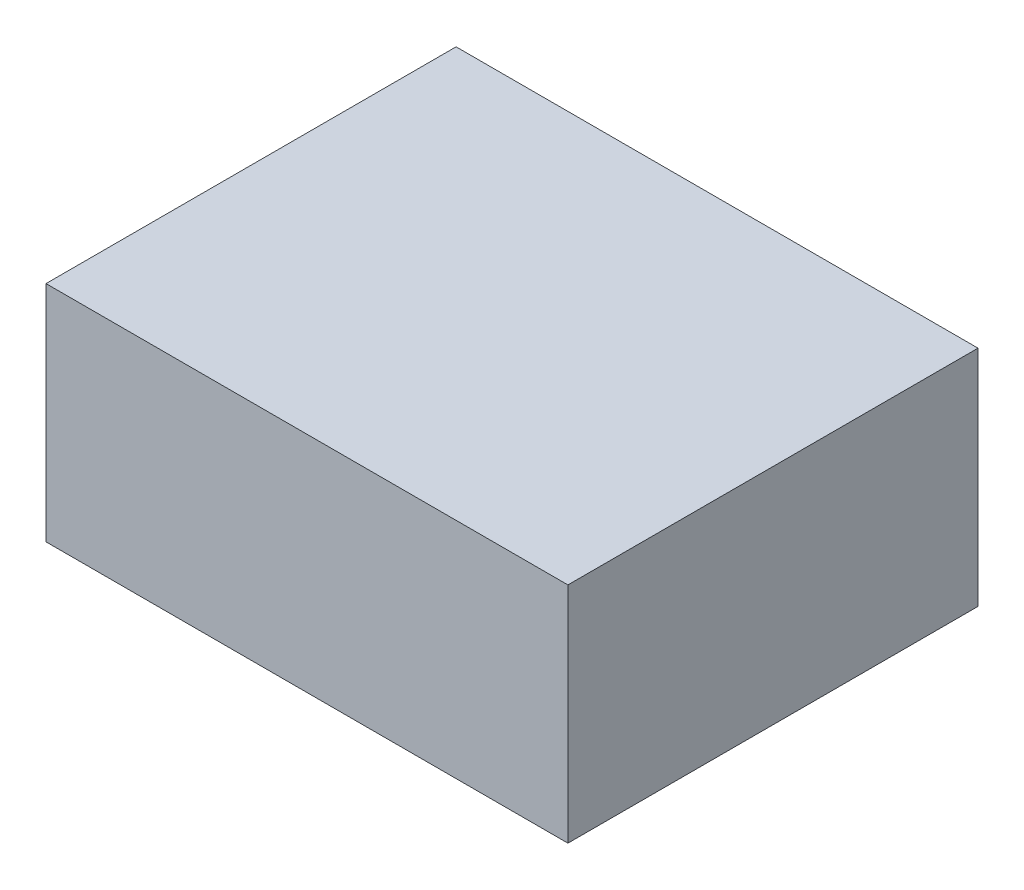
ISO-10303-21;
HEADER;
FILE_DESCRIPTION(('STEP AP214'),'2;1');
FILE_NAME('part.step','',(''),(''),'','','');
FILE_SCHEMA(('AUTOMOTIVE_DESIGN { 1 0 10303 214 1 1 1 1 }'));
ENDSEC;
DATA;
#1=APPLICATION_CONTEXT('core data for automotive mechanical design processes');
#2=APPLICATION_PROTOCOL_DEFINITION('international standard','automotive_design',2000,#1);
#3=PRODUCT_CONTEXT('',#1,'mechanical');
#4=PRODUCT('Part','Part','',(#3));
#5=PRODUCT_RELATED_PRODUCT_CATEGORY('part','',(#4));
#6=PRODUCT_DEFINITION_FORMATION('','',#4);
#7=PRODUCT_DEFINITION_CONTEXT('part definition',#1,'design');
#8=PRODUCT_DEFINITION('design','',#6,#7);
#9=PRODUCT_DEFINITION_SHAPE('','',#8);
#10=(LENGTH_UNIT() NAMED_UNIT(*) SI_UNIT(.MILLI.,.METRE.));
#11=(NAMED_UNIT(*) PLANE_ANGLE_UNIT() SI_UNIT($,.RADIAN.));
#12=(NAMED_UNIT(*) SI_UNIT($,.STERADIAN.) SOLID_ANGLE_UNIT());
#13=UNCERTAINTY_MEASURE_WITH_UNIT(LENGTH_MEASURE(1.E-05),#10,'distance_accuracy_value','');
#14=(GEOMETRIC_REPRESENTATION_CONTEXT(3) GLOBAL_UNCERTAINTY_ASSIGNED_CONTEXT((#13)) GLOBAL_UNIT_ASSIGNED_CONTEXT((#10,
#11,#12)) REPRESENTATION_CONTEXT('',''));
#15=CARTESIAN_POINT('',(0.,0.,0.));
#16=DIRECTION('',(0.,0.,1.));
#17=DIRECTION('',(1.,0.,0.));
#18=AXIS2_PLACEMENT_3D('',#15,#16,#17);
#19=CARTESIAN_POINT('',(0.,0.,0.5499989));
#20=DIRECTION('',(0.,0.,-1.));
#21=DIRECTION('',(0.,-1.,0.));
#22=AXIS2_PLACEMENT_3D('',#19,#20,#21);
#23=PLANE('',#22);
#24=DIRECTION('',(0.,1.,0.));
#25=VECTOR('',#24,1.);
#26=CARTESIAN_POINT('',(-0.3499993,-0.1499997,0.5499989));
#27=LINE('',#26,#25);
#28=CARTESIAN_POINT('',(-0.3499993,-0.1499997,0.5499989));
#29=VERTEX_POINT('',#28);
#30=CARTESIAN_POINT('',(-0.3499993,0.1499997,0.5499989));
#31=VERTEX_POINT('',#30);
#32=EDGE_CURVE('E27',#29,#31,#27,.T.);
#33=ORIENTED_EDGE('',*,*,#32,.F.);
#34=DIRECTION('',(-1.,0.,0.));
#35=VECTOR('',#34,1.);
#36=CARTESIAN_POINT('',(0.3499993,-0.1499997,0.5499989));
#37=LINE('',#36,#35);
#38=CARTESIAN_POINT('',(0.3499993,-0.1499997,0.5499989));
#39=VERTEX_POINT('',#38);
#40=EDGE_CURVE('E77',#39,#29,#37,.T.);
#41=ORIENTED_EDGE('',*,*,#40,.F.);
#42=DIRECTION('',(0.,-1.,0.));
#43=VECTOR('',#42,1.);
#44=CARTESIAN_POINT('',(0.3499993,0.1499997,0.5499989));
#45=LINE('',#44,#43);
#46=CARTESIAN_POINT('',(0.3499993,0.1499997,0.5499989));
#47=VERTEX_POINT('',#46);
#48=EDGE_CURVE('E81',#47,#39,#45,.T.);
#49=ORIENTED_EDGE('',*,*,#48,.F.);
#50=DIRECTION('',(1.,0.,0.));
#51=VECTOR('',#50,1.);
#52=CARTESIAN_POINT('',(-0.3499993,0.1499997,0.5499989));
#53=LINE('',#52,#51);
#54=EDGE_CURVE('E109',#31,#47,#53,.T.);
#55=ORIENTED_EDGE('',*,*,#54,.F.);
#56=EDGE_LOOP('',(#33,#41,#49,#55));
#57=FACE_BOUND('',#56,.T.);
#58=ADVANCED_FACE('F17',(#57),#23,.F.);
#59=CARTESIAN_POINT('',(0.,0.,0.));
#60=DIRECTION('',(0.,0.,-1.));
#61=DIRECTION('',(0.,-1.,0.));
#62=AXIS2_PLACEMENT_3D('',#59,#60,#61);
#63=PLANE('',#62);
#64=DIRECTION('',(1.,0.,0.));
#65=VECTOR('',#64,1.);
#66=CARTESIAN_POINT('',(-0.3499993,0.1499997,0.));
#67=LINE('',#66,#65);
#68=CARTESIAN_POINT('',(-0.3499993,0.1499997,0.));
#69=VERTEX_POINT('',#68);
#70=CARTESIAN_POINT('',(0.3499993,0.1499997,0.));
#71=VERTEX_POINT('',#70);
#72=EDGE_CURVE('E72',#69,#71,#67,.T.);
#73=ORIENTED_EDGE('',*,*,#72,.T.);
#74=DIRECTION('',(0.,-1.,0.));
#75=VECTOR('',#74,1.);
#76=CARTESIAN_POINT('',(0.3499993,0.1499997,0.));
#77=LINE('',#76,#75);
#78=CARTESIAN_POINT('',(0.3499993,-0.1499997,0.));
#79=VERTEX_POINT('',#78);
#80=EDGE_CURVE('E70',#71,#79,#77,.T.);
#81=ORIENTED_EDGE('',*,*,#80,.T.);
#82=DIRECTION('',(-1.,0.,0.));
#83=VECTOR('',#82,1.);
#84=CARTESIAN_POINT('',(0.3499993,-0.1499997,0.));
#85=LINE('',#84,#83);
#86=CARTESIAN_POINT('',(-0.3499993,-0.1499997,0.));
#87=VERTEX_POINT('',#86);
#88=EDGE_CURVE('E58',#79,#87,#85,.T.);
#89=ORIENTED_EDGE('',*,*,#88,.T.);
#90=DIRECTION('',(0.,1.,0.));
#91=VECTOR('',#90,1.);
#92=CARTESIAN_POINT('',(-0.3499993,-0.1499997,0.));
#93=LINE('',#92,#91);
#94=EDGE_CURVE('E11',#87,#69,#93,.T.);
#95=ORIENTED_EDGE('',*,*,#94,.T.);
#96=EDGE_LOOP('',(#73,#81,#89,#95));
#97=FACE_BOUND('',#96,.T.);
#98=ADVANCED_FACE('F19',(#97),#63,.T.);
#99=CARTESIAN_POINT('',(-0.3499993,-0.1499997,0.));
#100=DIRECTION('',(-1.,0.,0.));
#101=DIRECTION('',(0.,0.,1.));
#102=AXIS2_PLACEMENT_3D('',#99,#100,#101);
#103=PLANE('',#102);
#104=DIRECTION('',(0.,0.,1.));
#105=VECTOR('',#104,1.);
#106=CARTESIAN_POINT('',(-0.3499993,-0.1499997,0.));
#107=LINE('',#106,#105);
#108=EDGE_CURVE('E65',#87,#29,#107,.T.);
#109=ORIENTED_EDGE('',*,*,#108,.T.);
#110=ORIENTED_EDGE('',*,*,#32,.T.);
#111=DIRECTION('',(0.,0.,1.));
#112=VECTOR('',#111,1.);
#113=CARTESIAN_POINT('',(-0.3499993,0.1499997,0.));
#114=LINE('',#113,#112);
#115=EDGE_CURVE('E105',#69,#31,#114,.T.);
#116=ORIENTED_EDGE('',*,*,#115,.F.);
#117=ORIENTED_EDGE('',*,*,#94,.F.);
#118=EDGE_LOOP('',(#109,#110,#116,#117));
#119=FACE_BOUND('',#118,.T.);
#120=ADVANCED_FACE('F102',(#119),#103,.T.);
#121=CARTESIAN_POINT('',(0.3499993,-0.1499997,0.));
#122=DIRECTION('',(0.,-1.,0.));
#123=DIRECTION('',(0.,0.,-1.));
#124=AXIS2_PLACEMENT_3D('',#121,#122,#123);
#125=PLANE('',#124);
#126=DIRECTION('',(0.,0.,1.));
#127=VECTOR('',#126,1.);
#128=CARTESIAN_POINT('',(0.3499993,-0.1499997,0.));
#129=LINE('',#128,#127);
#130=EDGE_CURVE('E63',#79,#39,#129,.T.);
#131=ORIENTED_EDGE('',*,*,#130,.T.);
#132=ORIENTED_EDGE('',*,*,#40,.T.);
#133=ORIENTED_EDGE('',*,*,#108,.F.);
#134=ORIENTED_EDGE('',*,*,#88,.F.);
#135=EDGE_LOOP('',(#131,#132,#133,#134));
#136=FACE_BOUND('',#135,.T.);
#137=ADVANCED_FACE('F60',(#136),#125,.T.);
#138=CARTESIAN_POINT('',(0.3499993,0.1499997,0.));
#139=DIRECTION('',(1.,0.,0.));
#140=DIRECTION('',(0.,1.,0.));
#141=AXIS2_PLACEMENT_3D('',#138,#139,#140);
#142=PLANE('',#141);
#143=DIRECTION('',(0.,0.,1.));
#144=VECTOR('',#143,1.);
#145=CARTESIAN_POINT('',(0.3499993,0.1499997,0.));
#146=LINE('',#145,#144);
#147=EDGE_CURVE('E90',#71,#47,#146,.T.);
#148=ORIENTED_EDGE('',*,*,#147,.T.);
#149=ORIENTED_EDGE('',*,*,#48,.T.);
#150=ORIENTED_EDGE('',*,*,#130,.F.);
#151=ORIENTED_EDGE('',*,*,#80,.F.);
#152=EDGE_LOOP('',(#148,#149,#150,#151));
#153=FACE_BOUND('',#152,.T.);
#154=ADVANCED_FACE('F79',(#153),#142,.T.);
#155=CARTESIAN_POINT('',(-0.3499993,0.1499997,0.));
#156=DIRECTION('',(0.,1.,0.));
#157=DIRECTION('',(1.,0.,0.));
#158=AXIS2_PLACEMENT_3D('',#155,#156,#157);
#159=PLANE('',#158);
#160=ORIENTED_EDGE('',*,*,#115,.T.);
#161=ORIENTED_EDGE('',*,*,#54,.T.);
#162=ORIENTED_EDGE('',*,*,#147,.F.);
#163=ORIENTED_EDGE('',*,*,#72,.F.);
#164=EDGE_LOOP('',(#160,#161,#162,#163));
#165=FACE_BOUND('',#164,.T.);
#166=ADVANCED_FACE('F113',(#165),#159,.T.);
#167=CLOSED_SHELL('',(#58,#98,#120,#137,#154,#166));
#168=MANIFOLD_SOLID_BREP('B1',#167);
#169=ADVANCED_BREP_SHAPE_REPRESENTATION('',(#18,#168),#14);
#170=SHAPE_DEFINITION_REPRESENTATION(#9,#169);
ENDSEC;
END-ISO-10303-21;
